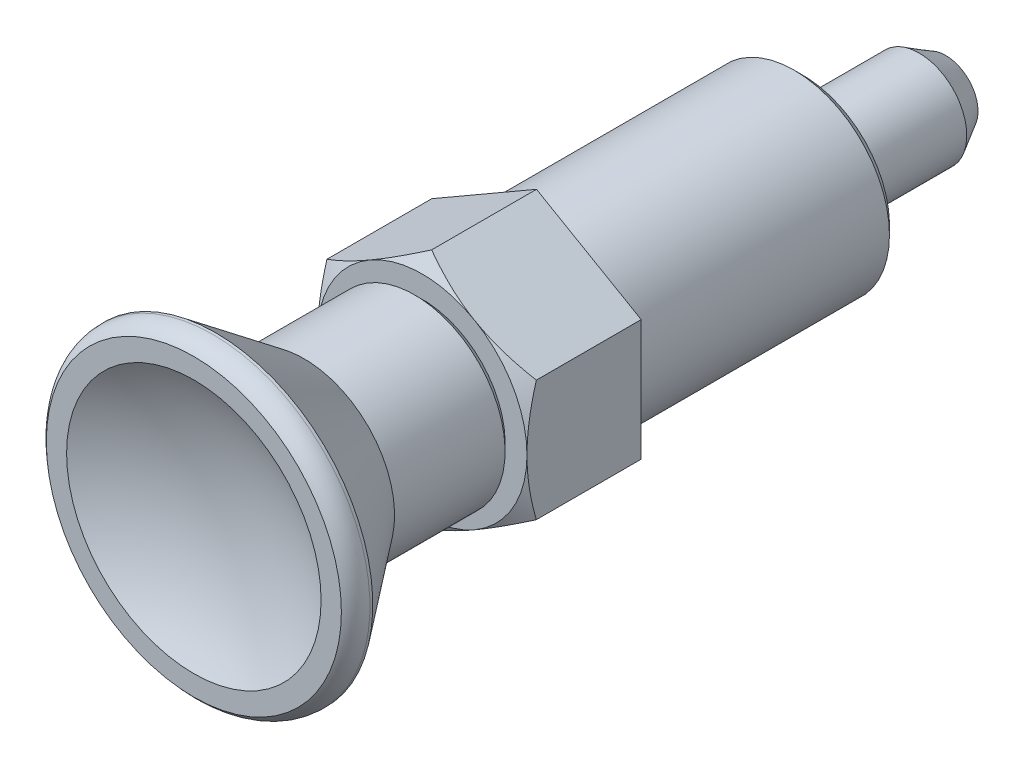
ISO-10303-21;
HEADER;
FILE_DESCRIPTION(('STEP AP214'),'2;1');
FILE_NAME('part.step','',(''),(''),'','','');
FILE_SCHEMA(('AUTOMOTIVE_DESIGN { 1 0 10303 214 1 1 1 1 }'));
ENDSEC;
DATA;
#1=APPLICATION_CONTEXT('core data for automotive mechanical design processes');
#2=APPLICATION_PROTOCOL_DEFINITION('international standard','automotive_design',2000,#1);
#3=PRODUCT_CONTEXT('',#1,'mechanical');
#4=PRODUCT('Part','Part','',(#3));
#5=PRODUCT_RELATED_PRODUCT_CATEGORY('part','',(#4));
#6=PRODUCT_DEFINITION_FORMATION('','',#4);
#7=PRODUCT_DEFINITION_CONTEXT('part definition',#1,'design');
#8=PRODUCT_DEFINITION('design','',#6,#7);
#9=PRODUCT_DEFINITION_SHAPE('','',#8);
#10=(LENGTH_UNIT() NAMED_UNIT(*) SI_UNIT(.MILLI.,.METRE.));
#11=(NAMED_UNIT(*) PLANE_ANGLE_UNIT() SI_UNIT($,.RADIAN.));
#12=(NAMED_UNIT(*) SI_UNIT($,.STERADIAN.) SOLID_ANGLE_UNIT());
#13=UNCERTAINTY_MEASURE_WITH_UNIT(LENGTH_MEASURE(1.E-05),#10,'distance_accuracy_value','');
#14=(GEOMETRIC_REPRESENTATION_CONTEXT(3) GLOBAL_UNCERTAINTY_ASSIGNED_CONTEXT((#13)) GLOBAL_UNIT_ASSIGNED_CONTEXT((#10,
#11,#12)) REPRESENTATION_CONTEXT('',''));
#15=CARTESIAN_POINT('',(0.,0.,0.));
#16=DIRECTION('',(0.,0.,1.));
#17=DIRECTION('',(1.,0.,0.));
#18=AXIS2_PLACEMENT_3D('',#15,#16,#17);
#19=CARTESIAN_POINT('',(0.,0.,10.2679491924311));
#20=DIRECTION('',(0.,0.,-1.));
#21=DIRECTION('',(0.,1.,0.));
#22=AXIS2_PLACEMENT_3D('',#19,#20,#21);
#23=CONICAL_SURFACE('',#22,14.,1.0471975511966);
#24=CARTESIAN_POINT('',(-11.,16.9475873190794,6.68579522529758));
#25=CARTESIAN_POINT('',(-11.,16.7078395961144,6.80189876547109));
#26=CARTESIAN_POINT('',(-11.,16.4678075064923,6.9174148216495));
#27=CARTESIAN_POINT('',(-11.,15.9871152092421,7.14713868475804));
#28=CARTESIAN_POINT('',(-11.,15.7464549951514,7.26134647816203));
#29=CARTESIAN_POINT('',(-11.,15.0233774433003,7.60183836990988));
#30=CARTESIAN_POINT('',(-11.,14.5399358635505,7.82595569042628));
#31=CARTESIAN_POINT('',(-11.,13.5670950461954,8.2682662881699));
#32=CARTESIAN_POINT('',(-11.,13.0776776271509,8.48641967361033));
#33=CARTESIAN_POINT('',(-11.,12.0949113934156,8.91365213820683));
#34=CARTESIAN_POINT('',(-11.,11.601562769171,9.12273165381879));
#35=CARTESIAN_POINT('',(-11.,10.5946510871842,9.53576885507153));
#36=CARTESIAN_POINT('',(-11.,10.0809379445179,9.73936259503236));
#37=CARTESIAN_POINT('',(-11.,9.04745673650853,10.130870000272));
#38=CARTESIAN_POINT('',(-11.,8.52768799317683,10.3187818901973));
#39=CARTESIAN_POINT('',(-11.,7.48229548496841,10.6739078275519));
#40=CARTESIAN_POINT('',(-11.,6.95668640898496,10.8411647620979));
#41=CARTESIAN_POINT('',(-11.,5.89787966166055,11.1495490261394));
#42=CARTESIAN_POINT('',(-11.,5.36468447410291,11.2906847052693));
#43=CARTESIAN_POINT('',(-11.,4.56058944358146,11.4772509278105));
#44=CARTESIAN_POINT('',(-11.,4.29255941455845,11.5351292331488));
#45=CARTESIAN_POINT('',(-11.,3.75468924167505,11.6418066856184));
#46=CARTESIAN_POINT('',(-11.,3.48484913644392,11.6906060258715));
#47=CARTESIAN_POINT('',(-11.,2.94355241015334,11.7782575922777));
#48=CARTESIAN_POINT('',(-11.,2.6720958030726,11.8171099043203));
#49=CARTESIAN_POINT('',(-11.,2.12786354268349,11.8840882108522));
#50=CARTESIAN_POINT('',(-11.,1.85508793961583,11.9122146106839));
#51=CARTESIAN_POINT('',(-11.,1.31211051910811,11.9568359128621));
#52=CARTESIAN_POINT('',(-11.,1.04192067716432,11.9734756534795));
#53=CARTESIAN_POINT('',(-11.,0.501080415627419,11.9953220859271));
#54=CARTESIAN_POINT('',(-11.,0.230430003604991,12.0005289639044));
#55=CARTESIAN_POINT('',(-11.,-0.310849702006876,11.9993861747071));
#56=CARTESIAN_POINT('',(-11.,-0.581478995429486,11.9930364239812));
#57=CARTESIAN_POINT('',(-11.,-1.12223262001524,11.9689333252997));
#58=CARTESIAN_POINT('',(-11.,-1.39235692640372,11.9511794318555));
#59=CARTESIAN_POINT('',(-11.,-2.04498166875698,11.8948814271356));
#60=CARTESIAN_POINT('',(-11.,-2.42700715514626,11.8507360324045));
#61=CARTESIAN_POINT('',(-11.,-3.18815089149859,11.7420670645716));
#62=CARTESIAN_POINT('',(-11.,-3.56726872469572,11.6775406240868));
#63=CARTESIAN_POINT('',(-11.,-4.32226099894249,11.5304052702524));
#64=CARTESIAN_POINT('',(-11.,-4.69813259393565,11.4477818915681));
#65=CARTESIAN_POINT('',(-11.,-5.44607034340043,11.2669675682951));
#66=CARTESIAN_POINT('',(-11.,-5.81813656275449,11.1687768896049));
#67=CARTESIAN_POINT('',(-11.,-6.56654933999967,10.9569168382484));
#68=CARTESIAN_POINT('',(-11.,-6.94281324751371,10.8429575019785));
#69=CARTESIAN_POINT('',(-11.,-7.69163354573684,10.6035085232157));
#70=CARTESIAN_POINT('',(-11.,-8.0641899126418,10.4780188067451));
#71=CARTESIAN_POINT('',(-11.,-8.80578324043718,10.2174800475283));
#72=CARTESIAN_POINT('',(-11.,-9.17482138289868,10.0824343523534));
#73=CARTESIAN_POINT('',(-11.,-9.90985646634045,9.80434835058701));
#74=CARTESIAN_POINT('',(-11.,-10.2758534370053,9.6613081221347));
#75=CARTESIAN_POINT('',(-11.,-11.1142135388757,9.3247854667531));
#76=CARTESIAN_POINT('',(-11.,-11.5856547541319,9.12901029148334));
#77=CARTESIAN_POINT('',(-11.,-12.5247285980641,8.7285047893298));
#78=CARTESIAN_POINT('',(-11.,-12.9923610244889,8.52377399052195));
#79=CARTESIAN_POINT('',(-11.,-13.9244936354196,8.10708188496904));
#80=CARTESIAN_POINT('',(-11.,-14.3889931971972,7.89511918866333));
#81=CARTESIAN_POINT('',(-11.,-15.3152712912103,7.46536426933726));
#82=CARTESIAN_POINT('',(-11.,-15.7770498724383,7.24757215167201));
#83=CARTESIAN_POINT('',(-11.,-16.6987730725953,6.80699211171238));
#84=CARTESIAN_POINT('',(-11.,-17.1587154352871,6.58419947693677));
#85=CARTESIAN_POINT('',(-11.,-18.0766600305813,6.13465365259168));
#86=CARTESIAN_POINT('',(-11.,-18.5346622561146,5.90790044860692));
#87=CARTESIAN_POINT('',(-11.,-19.4489632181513,5.45111550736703));
#88=CARTESIAN_POINT('',(-11.,-19.9052621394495,5.22108413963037));
#89=CARTESIAN_POINT('',(-11.,-20.8164463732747,4.75823700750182));
#90=CARTESIAN_POINT('',(-11.,-21.2713316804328,4.52542123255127));
#91=CARTESIAN_POINT('',(-11.,-22.562113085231,3.86056086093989));
#92=CARTESIAN_POINT('',(-11.,-23.3965608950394,3.42570443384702));
#93=CARTESIAN_POINT('',(-11.,-25.0623255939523,2.54998818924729));
#94=CARTESIAN_POINT('',(-11.,-25.893642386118,2.10912818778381));
#95=CARTESIAN_POINT('',(-11.,-27.5519148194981,1.22379199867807));
#96=CARTESIAN_POINT('',(-11.,-28.3788760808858,0.77932633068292));
#97=CARTESIAN_POINT('',(-11.,-29.6178277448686,0.109922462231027));
#98=CARTESIAN_POINT('',(-11.,-30.0305531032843,-0.113657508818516));
#99=CARTESIAN_POINT('',(-11.,-30.8555616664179,-0.561630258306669));
#100=CARTESIAN_POINT('',(-11.,-31.2678448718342,-0.786023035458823));
#101=CARTESIAN_POINT('',(-11.,-31.6799315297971,-1.0107762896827));
#102=B_SPLINE_CURVE_WITH_KNOTS('',3,(#24,#25,#26,#27,#28,#29,#30,#31,#32,#33,#34,#35,#36,#37,
#38,#39,#40,#41,#42,#43,#44,#45,#46,#47,#48,#49,#50,#51,#52,#53,#54,#55,#56,#57,#58,#59,#60,#61,
#62,#63,#64,#65,#66,#67,#68,#69,#70,#71,#72,#73,#74,#75,#76,#77,#78,#79,#80,#81,#82,#83,#84,#85,
#86,#87,#88,#89,#90,#91,#92,#93,#94,#95,#96,#97,#98,#99,#100,#101),.UNSPECIFIED.,.F.,.F.,(4,2,2,
2,2,2,2,2,2,2,2,2,2,2,2,2,2,2,2,2,2,2,2,2,2,2,2,2,2,2,2,2,2,2,2,2,2,2,4),(0.,0.799142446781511,
1.5982931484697,3.19683688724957,4.80427343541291,6.41163257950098,8.0691960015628,
9.72694682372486,11.3811955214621,13.0349145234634,13.8574094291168,14.6798868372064,
15.5023571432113,16.3247963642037,17.1366658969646,17.9485222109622,18.7603843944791,
19.5722854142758,20.7253478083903,21.8785724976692,23.0327223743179,24.1868525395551,
25.3660595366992,26.5452741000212,27.7240775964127,28.902869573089,30.434171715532,
31.9655546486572,33.4972335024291,35.0288846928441,36.5620455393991,38.0952119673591,
39.6282069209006,41.1612076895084,43.9840470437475,46.8069730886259,49.6234714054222,
51.0316511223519,52.439828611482),.UNSPECIFIED.);
#103=CARTESIAN_POINT('',(-11.,-6.3508529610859,11.0175196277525));
#104=VERTEX_POINT('',#103);
#105=CARTESIAN_POINT('',(-11.,0.,12.));
#106=VERTEX_POINT('',#105);
#107=EDGE_CURVE('E9',#104,#106,#102,.F.);
#108=ORIENTED_EDGE('',*,*,#107,.F.);
#109=CARTESIAN_POINT('',(0.000200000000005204,-12.7018213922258,11.0174529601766));
#110=CARTESIAN_POINT('',(-0.241603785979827,-12.5622159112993,11.0980408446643));
#111=CARTESIAN_POINT('',(-0.484309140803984,-12.4220899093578,11.1749710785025));
#112=CARTESIAN_POINT('',(-0.971666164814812,-12.1407142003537,11.3205013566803));
#113=CARTESIAN_POINT('',(-1.21631844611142,-11.9994641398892,11.3890986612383));
#114=CARTESIAN_POINT('',(-1.95421736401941,-11.5734380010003,11.5810636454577));
#115=CARTESIAN_POINT('',(-2.45037695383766,-11.2869801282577,11.6902522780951));
#116=CARTESIAN_POINT('',(-3.19285703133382,-10.8583090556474,11.8182858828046));
#117=CARTESIAN_POINT('',(-3.43695934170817,-10.7173765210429,11.8547577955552));
#118=CARTESIAN_POINT('',(-3.9262941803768,-10.4348589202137,11.9159186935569));
#119=CARTESIAN_POINT('',(-4.17152673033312,-10.2932738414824,11.9406074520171));
#120=CARTESIAN_POINT('',(-4.66240068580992,-10.0098676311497,11.9775696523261));
#121=CARTESIAN_POINT('',(-4.90804125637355,-9.86804698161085,11.9898578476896));
#122=CARTESIAN_POINT('',(-5.3995500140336,-9.58427426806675,12.0017570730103));
#123=CARTESIAN_POINT('',(-5.64541819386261,-9.4423222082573,12.0013684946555));
#124=CARTESIAN_POINT('',(-6.10507018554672,-9.17694200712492,11.9887988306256));
#125=CARTESIAN_POINT('',(-6.31888677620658,-9.05349494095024,11.9781509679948));
#126=CARTESIAN_POINT('',(-6.7460281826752,-8.80688473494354,11.9474683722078));
#127=CARTESIAN_POINT('',(-6.95935296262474,-8.68372161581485,11.9274329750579));
#128=CARTESIAN_POINT('',(-7.38539481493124,-8.43774623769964,11.8783246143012));
#129=CARTESIAN_POINT('',(-7.59811123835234,-8.31493435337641,11.8492441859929));
#130=CARTESIAN_POINT('',(-8.02254681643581,-8.06988635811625,11.7825560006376));
#131=CARTESIAN_POINT('',(-8.23426590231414,-7.94765028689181,11.7449476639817));
#132=CARTESIAN_POINT('',(-8.87695113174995,-7.57659579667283,11.6183800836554));
#133=CARTESIAN_POINT('',(-9.30605612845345,-7.32885191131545,11.5168005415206));
#134=CARTESIAN_POINT('',(-10.1578675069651,-6.83705838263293,11.286256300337));
#135=CARTESIAN_POINT('',(-10.580584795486,-6.59300244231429,11.1573457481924));
#136=CARTESIAN_POINT('',(-11.0002,-6.35073749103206,11.0174529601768));
#137=B_SPLINE_CURVE_WITH_KNOTS('',3,(#109,#110,#111,#112,#113,#114,#115,#116,#117,#118,#119,
#120,#121,#122,#123,#124,#125,#126,#127,#128,#129,#130,#131,#132,#133,#134,#135,#136),
.UNSPECIFIED.,.F.,.F.,(4,2,2,2,2,2,2,2,2,2,2,2,2,4),(0.,0.871755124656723,1.74379610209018,
3.49159027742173,4.34403665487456,5.19649943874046,6.04794680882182,6.89936787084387,
7.64056020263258,8.38180496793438,9.12366309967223,9.86557166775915,11.3820155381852,
12.8954827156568),.UNSPECIFIED.);
#138=CARTESIAN_POINT('',(-5.50000000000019,-9.52627944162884,12.));
#139=VERTEX_POINT('',#138);
#140=EDGE_CURVE('E201',#139,#104,#137,.T.);
#141=ORIENTED_EDGE('',*,*,#140,.F.);
#142=CARTESIAN_POINT('',(0.,0.,12.));
#143=DIRECTION('',(0.,0.,1.));
#144=DIRECTION('',(0.,-1.,0.));
#145=AXIS2_PLACEMENT_3D('',#142,#143,#144);
#146=CIRCLE('',#145,11.);
#147=EDGE_CURVE('E259',#106,#139,#146,.T.);
#148=ORIENTED_EDGE('',*,*,#147,.F.);
#149=EDGE_LOOP('',(#108,#141,#148));
#150=FACE_BOUND('',#149,.T.);
#151=ADVANCED_FACE('F14',(#150),#23,.T.);
#152=CARTESIAN_POINT('',(-11.,6.3508529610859,11.0175196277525));
#153=VERTEX_POINT('',#152);
#154=EDGE_CURVE('E18',#106,#153,#102,.F.);
#155=ORIENTED_EDGE('',*,*,#154,.F.);
#156=CARTESIAN_POINT('',(-5.50000000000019,9.52627944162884,12.));
#157=VERTEX_POINT('',#156);
#158=EDGE_CURVE('E116',#157,#106,#146,.T.);
#159=ORIENTED_EDGE('',*,*,#158,.F.);
#160=CARTESIAN_POINT('',(-11.0002,6.35073749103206,11.0174529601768));
#161=CARTESIAN_POINT('',(-10.7583962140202,6.49034297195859,11.0980408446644));
#162=CARTESIAN_POINT('',(-10.515690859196,6.63046897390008,11.1749710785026));
#163=CARTESIAN_POINT('',(-10.0283338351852,6.91184468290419,11.3205013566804));
#164=CARTESIAN_POINT('',(-9.78368155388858,7.05309474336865,11.3890986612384));
#165=CARTESIAN_POINT('',(-9.04578263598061,7.47912088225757,11.5810636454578));
#166=CARTESIAN_POINT('',(-8.54962304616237,7.76557875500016,11.6902522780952));
#167=CARTESIAN_POINT('',(-7.80714296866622,8.19424982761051,11.8182858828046));
#168=CARTESIAN_POINT('',(-7.56304065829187,8.33518236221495,11.8547577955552));
#169=CARTESIAN_POINT('',(-7.07370581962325,8.61769996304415,11.9159186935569));
#170=CARTESIAN_POINT('',(-6.82847326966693,8.7592850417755,11.9406074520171));
#171=CARTESIAN_POINT('',(-6.33759931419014,9.04269125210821,11.9775696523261));
#172=CARTESIAN_POINT('',(-6.09195874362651,9.18451190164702,11.9898578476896));
#173=CARTESIAN_POINT('',(-5.60044998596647,9.46828461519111,12.0017570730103));
#174=CARTESIAN_POINT('',(-5.35458180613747,9.61023667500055,12.0013684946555));
#175=CARTESIAN_POINT('',(-4.89492981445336,9.87561687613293,11.9887988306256));
#176=CARTESIAN_POINT('',(-4.6811132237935,9.99906394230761,11.9781509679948));
#177=CARTESIAN_POINT('',(-4.25397181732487,10.2456741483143,11.9474683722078));
#178=CARTESIAN_POINT('',(-4.04064703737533,10.368837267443,11.9274329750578));
#179=CARTESIAN_POINT('',(-3.61460518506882,10.6148126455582,11.8783246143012));
#180=CARTESIAN_POINT('',(-3.40188876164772,10.7376245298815,11.8492441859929));
#181=CARTESIAN_POINT('',(-2.97745318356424,10.9826725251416,11.7825560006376));
#182=CARTESIAN_POINT('',(-2.76573409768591,11.1049085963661,11.7449476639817));
#183=CARTESIAN_POINT('',(-2.12304886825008,11.475963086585,11.6183800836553));
#184=CARTESIAN_POINT('',(-1.69394387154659,11.7237069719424,11.5168005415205));
#185=CARTESIAN_POINT('',(-0.842132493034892,12.215500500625,11.2862563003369));
#186=CARTESIAN_POINT('',(-0.41941520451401,12.4595564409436,11.1573457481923));
#187=CARTESIAN_POINT('',(0.000199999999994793,12.7018213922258,11.0174529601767));
#188=B_SPLINE_CURVE_WITH_KNOTS('',3,(#160,#161,#162,#163,#164,#165,#166,#167,#168,#169,#170,
#171,#172,#173,#174,#175,#176,#177,#178,#179,#180,#181,#182,#183,#184,#185,#186,#187),
.UNSPECIFIED.,.F.,.F.,(4,2,2,2,2,2,2,2,2,2,2,2,2,4),(0.,0.871755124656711,1.74379610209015,
3.49159027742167,4.34403665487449,5.19649943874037,6.04794680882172,6.89936787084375,
7.64056020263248,8.38180496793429,9.12366309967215,9.86557166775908,11.3820155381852,
12.8954827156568),.UNSPECIFIED.);
#189=EDGE_CURVE('E262',#153,#157,#188,.T.);
#190=ORIENTED_EDGE('',*,*,#189,.F.);
#191=EDGE_LOOP('',(#155,#159,#190));
#192=FACE_BOUND('',#191,.T.);
#193=ADVANCED_FACE('F223',(#192),#23,.T.);
#194=CARTESIAN_POINT('',(0.,12.701705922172,11.0175196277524));
#195=VERTEX_POINT('',#194);
#196=EDGE_CURVE('E112',#157,#195,#188,.T.);
#197=ORIENTED_EDGE('',*,*,#196,.F.);
#198=CARTESIAN_POINT('',(5.50000000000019,9.52627944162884,12.));
#199=VERTEX_POINT('',#198);
#200=EDGE_CURVE('E110',#199,#157,#146,.T.);
#201=ORIENTED_EDGE('',*,*,#200,.F.);
#202=CARTESIAN_POINT('',(-0.000200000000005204,12.7018213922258,11.0174529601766));
#203=CARTESIAN_POINT('',(0.241603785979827,12.5622159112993,11.0980408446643));
#204=CARTESIAN_POINT('',(0.484309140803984,12.4220899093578,11.1749710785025));
#205=CARTESIAN_POINT('',(0.971666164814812,12.1407142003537,11.3205013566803));
#206=CARTESIAN_POINT('',(1.21631844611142,11.9994641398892,11.3890986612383));
#207=CARTESIAN_POINT('',(1.95421736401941,11.5734380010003,11.5810636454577));
#208=CARTESIAN_POINT('',(2.45037695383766,11.2869801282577,11.6902522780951));
#209=CARTESIAN_POINT('',(3.19285703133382,10.8583090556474,11.8182858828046));
#210=CARTESIAN_POINT('',(3.43695934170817,10.7173765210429,11.8547577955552));
#211=CARTESIAN_POINT('',(3.9262941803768,10.4348589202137,11.9159186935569));
#212=CARTESIAN_POINT('',(4.17152673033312,10.2932738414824,11.9406074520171));
#213=CARTESIAN_POINT('',(4.66240068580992,10.0098676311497,11.9775696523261));
#214=CARTESIAN_POINT('',(4.90804125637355,9.86804698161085,11.9898578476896));
#215=CARTESIAN_POINT('',(5.3995500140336,9.58427426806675,12.0017570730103));
#216=CARTESIAN_POINT('',(5.64541819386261,9.4423222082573,12.0013684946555));
#217=CARTESIAN_POINT('',(6.10507018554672,9.17694200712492,11.9887988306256));
#218=CARTESIAN_POINT('',(6.31888677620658,9.05349494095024,11.9781509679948));
#219=CARTESIAN_POINT('',(6.7460281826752,8.80688473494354,11.9474683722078));
#220=CARTESIAN_POINT('',(6.95935296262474,8.68372161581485,11.9274329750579));
#221=CARTESIAN_POINT('',(7.38539481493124,8.43774623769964,11.8783246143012));
#222=CARTESIAN_POINT('',(7.59811123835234,8.31493435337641,11.8492441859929));
#223=CARTESIAN_POINT('',(8.02254681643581,8.06988635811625,11.7825560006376));
#224=CARTESIAN_POINT('',(8.23426590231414,7.94765028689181,11.7449476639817));
#225=CARTESIAN_POINT('',(8.87695113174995,7.57659579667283,11.6183800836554));
#226=CARTESIAN_POINT('',(9.30605612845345,7.32885191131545,11.5168005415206));
#227=CARTESIAN_POINT('',(10.1578675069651,6.83705838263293,11.286256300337));
#228=CARTESIAN_POINT('',(10.580584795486,6.59300244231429,11.1573457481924));
#229=CARTESIAN_POINT('',(11.0002,6.35073749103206,11.0174529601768));
#230=B_SPLINE_CURVE_WITH_KNOTS('',3,(#202,#203,#204,#205,#206,#207,#208,#209,#210,#211,#212,
#213,#214,#215,#216,#217,#218,#219,#220,#221,#222,#223,#224,#225,#226,#227,#228,#229),
.UNSPECIFIED.,.F.,.F.,(4,2,2,2,2,2,2,2,2,2,2,2,2,4),(0.,0.871755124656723,1.74379610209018,
3.49159027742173,4.34403665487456,5.19649943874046,6.04794680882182,6.89936787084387,
7.64056020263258,8.38180496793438,9.12366309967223,9.86557166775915,11.3820155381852,
12.8954827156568),.UNSPECIFIED.);
#231=EDGE_CURVE('E90',#195,#199,#230,.T.);
#232=ORIENTED_EDGE('',*,*,#231,.F.);
#233=EDGE_LOOP('',(#197,#201,#232));
#234=FACE_BOUND('',#233,.T.);
#235=ADVANCED_FACE('F111',(#234),#23,.T.);
#236=CARTESIAN_POINT('',(0.,-12.701705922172,11.0175196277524));
#237=VERTEX_POINT('',#236);
#238=EDGE_CURVE('E196',#237,#139,#137,.T.);
#239=ORIENTED_EDGE('',*,*,#238,.F.);
#240=CARTESIAN_POINT('',(11.0002,-6.35073749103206,11.0174529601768));
#241=CARTESIAN_POINT('',(10.7583962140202,-6.49034297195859,11.0980408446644));
#242=CARTESIAN_POINT('',(10.515690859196,-6.63046897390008,11.1749710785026));
#243=CARTESIAN_POINT('',(10.0283338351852,-6.91184468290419,11.3205013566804));
#244=CARTESIAN_POINT('',(9.78368155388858,-7.05309474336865,11.3890986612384));
#245=CARTESIAN_POINT('',(9.04578263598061,-7.47912088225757,11.5810636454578));
#246=CARTESIAN_POINT('',(8.54962304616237,-7.76557875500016,11.6902522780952));
#247=CARTESIAN_POINT('',(7.80714296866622,-8.19424982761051,11.8182858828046));
#248=CARTESIAN_POINT('',(7.56304065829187,-8.33518236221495,11.8547577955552));
#249=CARTESIAN_POINT('',(7.07370581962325,-8.61769996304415,11.9159186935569));
#250=CARTESIAN_POINT('',(6.82847326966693,-8.7592850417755,11.9406074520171));
#251=CARTESIAN_POINT('',(6.33759931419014,-9.04269125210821,11.9775696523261));
#252=CARTESIAN_POINT('',(6.09195874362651,-9.18451190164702,11.9898578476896));
#253=CARTESIAN_POINT('',(5.60044998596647,-9.46828461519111,12.0017570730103));
#254=CARTESIAN_POINT('',(5.35458180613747,-9.61023667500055,12.0013684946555));
#255=CARTESIAN_POINT('',(4.89492981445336,-9.87561687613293,11.9887988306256));
#256=CARTESIAN_POINT('',(4.6811132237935,-9.99906394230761,11.9781509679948));
#257=CARTESIAN_POINT('',(4.25397181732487,-10.2456741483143,11.9474683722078));
#258=CARTESIAN_POINT('',(4.04064703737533,-10.368837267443,11.9274329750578));
#259=CARTESIAN_POINT('',(3.61460518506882,-10.6148126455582,11.8783246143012));
#260=CARTESIAN_POINT('',(3.40188876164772,-10.7376245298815,11.8492441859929));
#261=CARTESIAN_POINT('',(2.97745318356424,-10.9826725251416,11.7825560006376));
#262=CARTESIAN_POINT('',(2.76573409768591,-11.1049085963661,11.7449476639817));
#263=CARTESIAN_POINT('',(2.12304886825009,-11.475963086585,11.6183800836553));
#264=CARTESIAN_POINT('',(1.69394387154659,-11.7237069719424,11.5168005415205));
#265=CARTESIAN_POINT('',(0.842132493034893,-12.215500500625,11.2862563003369));
#266=CARTESIAN_POINT('',(0.419415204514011,-12.4595564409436,11.1573457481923));
#267=CARTESIAN_POINT('',(-0.00019999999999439,-12.7018213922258,11.0174529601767));
#268=B_SPLINE_CURVE_WITH_KNOTS('',3,(#240,#241,#242,#243,#244,#245,#246,#247,#248,#249,#250,
#251,#252,#253,#254,#255,#256,#257,#258,#259,#260,#261,#262,#263,#264,#265,#266,#267),
.UNSPECIFIED.,.F.,.F.,(4,2,2,2,2,2,2,2,2,2,2,2,2,4),(0.,0.871755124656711,1.74379610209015,
3.49159027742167,4.34403665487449,5.19649943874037,6.04794680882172,6.89936787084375,
7.64056020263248,8.38180496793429,9.12366309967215,9.86557166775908,11.3820155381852,
12.8954827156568),.UNSPECIFIED.);
#269=CARTESIAN_POINT('',(5.50000000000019,-9.52627944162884,12.));
#270=VERTEX_POINT('',#269);
#271=EDGE_CURVE('E100',#270,#237,#268,.T.);
#272=ORIENTED_EDGE('',*,*,#271,.F.);
#273=EDGE_CURVE('E123',#139,#270,#146,.T.);
#274=ORIENTED_EDGE('',*,*,#273,.F.);
#275=EDGE_LOOP('',(#239,#272,#274));
#276=FACE_BOUND('',#275,.T.);
#277=ADVANCED_FACE('F241',(#276),#23,.T.);
#278=CARTESIAN_POINT('',(11.,6.3508529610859,11.0175196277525));
#279=VERTEX_POINT('',#278);
#280=EDGE_CURVE('E94',#199,#279,#230,.T.);
#281=ORIENTED_EDGE('',*,*,#280,.F.);
#282=CARTESIAN_POINT('',(11.,0.,12.));
#283=VERTEX_POINT('',#282);
#284=EDGE_CURVE('E106',#283,#199,#146,.T.);
#285=ORIENTED_EDGE('',*,*,#284,.F.);
#286=CARTESIAN_POINT('',(11.,16.9475873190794,6.68579522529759));
#287=CARTESIAN_POINT('',(11.,16.7078395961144,6.8018987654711));
#288=CARTESIAN_POINT('',(11.,16.4678075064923,6.9174148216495));
#289=CARTESIAN_POINT('',(11.,15.9871152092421,7.14713868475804));
#290=CARTESIAN_POINT('',(11.,15.7464549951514,7.26134647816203));
#291=CARTESIAN_POINT('',(11.,15.0233774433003,7.60183836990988));
#292=CARTESIAN_POINT('',(11.,14.5399358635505,7.82595569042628));
#293=CARTESIAN_POINT('',(11.,13.5670950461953,8.26826628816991));
#294=CARTESIAN_POINT('',(11.,13.0776776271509,8.48641967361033));
#295=CARTESIAN_POINT('',(11.,12.0949113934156,8.91365213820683));
#296=CARTESIAN_POINT('',(11.,11.601562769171,9.12273165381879));
#297=CARTESIAN_POINT('',(11.,10.5946510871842,9.53576885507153));
#298=CARTESIAN_POINT('',(11.,10.0809379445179,9.73936259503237));
#299=CARTESIAN_POINT('',(11.,9.04745673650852,10.1308700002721));
#300=CARTESIAN_POINT('',(11.,8.52768799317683,10.3187818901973));
#301=CARTESIAN_POINT('',(11.,7.48229548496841,10.6739078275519));
#302=CARTESIAN_POINT('',(11.,6.95668640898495,10.8411647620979));
#303=CARTESIAN_POINT('',(11.,5.89787966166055,11.1495490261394));
#304=CARTESIAN_POINT('',(11.,5.36468447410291,11.2906847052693));
#305=CARTESIAN_POINT('',(11.,4.56058944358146,11.4772509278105));
#306=CARTESIAN_POINT('',(11.,4.29255941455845,11.5351292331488));
#307=CARTESIAN_POINT('',(11.,3.75468924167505,11.6418066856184));
#308=CARTESIAN_POINT('',(11.,3.48484913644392,11.6906060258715));
#309=CARTESIAN_POINT('',(11.,2.94355241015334,11.7782575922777));
#310=CARTESIAN_POINT('',(11.,2.6720958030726,11.8171099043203));
#311=CARTESIAN_POINT('',(11.,2.12786354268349,11.8840882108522));
#312=CARTESIAN_POINT('',(11.,1.85508793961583,11.9122146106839));
#313=CARTESIAN_POINT('',(11.,1.31211051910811,11.9568359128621));
#314=CARTESIAN_POINT('',(11.,1.04192067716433,11.9734756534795));
#315=CARTESIAN_POINT('',(11.,0.50108041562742,11.9953220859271));
#316=CARTESIAN_POINT('',(11.,0.230430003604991,12.0005289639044));
#317=CARTESIAN_POINT('',(11.,-0.310849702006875,11.9993861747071));
#318=CARTESIAN_POINT('',(11.,-0.581478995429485,11.9930364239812));
#319=CARTESIAN_POINT('',(11.,-1.12223262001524,11.9689333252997));
#320=CARTESIAN_POINT('',(11.,-1.39235692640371,11.9511794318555));
#321=CARTESIAN_POINT('',(11.,-2.04498166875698,11.8948814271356));
#322=CARTESIAN_POINT('',(11.,-2.42700715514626,11.8507360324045));
#323=CARTESIAN_POINT('',(11.,-3.18815089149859,11.7420670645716));
#324=CARTESIAN_POINT('',(11.,-3.56726872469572,11.6775406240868));
#325=CARTESIAN_POINT('',(11.,-4.32226099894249,11.5304052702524));
#326=CARTESIAN_POINT('',(11.,-4.69813259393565,11.4477818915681));
#327=CARTESIAN_POINT('',(11.,-5.44607034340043,11.2669675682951));
#328=CARTESIAN_POINT('',(11.,-5.81813656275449,11.1687768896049));
#329=CARTESIAN_POINT('',(11.,-6.56654933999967,10.9569168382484));
#330=CARTESIAN_POINT('',(11.,-6.94281324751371,10.8429575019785));
#331=CARTESIAN_POINT('',(11.,-7.69163354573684,10.6035085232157));
#332=CARTESIAN_POINT('',(11.,-8.0641899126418,10.4780188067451));
#333=CARTESIAN_POINT('',(11.,-8.80578324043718,10.2174800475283));
#334=CARTESIAN_POINT('',(11.,-9.17482138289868,10.0824343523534));
#335=CARTESIAN_POINT('',(11.,-9.90985646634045,9.80434835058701));
#336=CARTESIAN_POINT('',(11.,-10.2758534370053,9.6613081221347));
#337=CARTESIAN_POINT('',(11.,-11.1142135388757,9.3247854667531));
#338=CARTESIAN_POINT('',(11.,-11.5856547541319,9.12901029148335));
#339=CARTESIAN_POINT('',(11.,-12.5247285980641,8.7285047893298));
#340=CARTESIAN_POINT('',(11.,-12.9923610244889,8.52377399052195));
#341=CARTESIAN_POINT('',(11.,-13.9244936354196,8.10708188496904));
#342=CARTESIAN_POINT('',(11.,-14.3889931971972,7.89511918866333));
#343=CARTESIAN_POINT('',(11.,-15.3152712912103,7.46536426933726));
#344=CARTESIAN_POINT('',(11.,-15.7770498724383,7.24757215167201));
#345=CARTESIAN_POINT('',(11.,-16.6987730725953,6.80699211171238));
#346=CARTESIAN_POINT('',(11.,-17.1587154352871,6.58419947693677));
#347=CARTESIAN_POINT('',(11.,-18.0766600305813,6.13465365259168));
#348=CARTESIAN_POINT('',(11.,-18.5346622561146,5.90790044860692));
#349=CARTESIAN_POINT('',(11.,-19.4489632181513,5.45111550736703));
#350=CARTESIAN_POINT('',(11.,-19.9052621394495,5.22108413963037));
#351=CARTESIAN_POINT('',(11.,-20.8164463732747,4.75823700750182));
#352=CARTESIAN_POINT('',(11.,-21.2713316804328,4.52542123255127));
#353=CARTESIAN_POINT('',(11.,-22.562113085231,3.86056086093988));
#354=CARTESIAN_POINT('',(11.,-23.3965608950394,3.42570443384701));
#355=CARTESIAN_POINT('',(11.,-25.0623255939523,2.54998818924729));
#356=CARTESIAN_POINT('',(11.,-25.893642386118,2.10912818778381));
#357=CARTESIAN_POINT('',(11.,-27.5519148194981,1.22379199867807));
#358=CARTESIAN_POINT('',(11.,-28.3788760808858,0.779326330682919));
#359=CARTESIAN_POINT('',(11.,-29.6178277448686,0.109922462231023));
#360=CARTESIAN_POINT('',(11.,-30.0305531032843,-0.113657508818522));
#361=CARTESIAN_POINT('',(11.,-30.8555616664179,-0.561630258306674));
#362=CARTESIAN_POINT('',(11.,-31.2678448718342,-0.786023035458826));
#363=CARTESIAN_POINT('',(11.,-31.6799315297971,-1.0107762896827));
#364=B_SPLINE_CURVE_WITH_KNOTS('',3,(#286,#287,#288,#289,#290,#291,#292,#293,#294,#295,#296,
#297,#298,#299,#300,#301,#302,#303,#304,#305,#306,#307,#308,#309,#310,#311,#312,#313,#314,#315,
#316,#317,#318,#319,#320,#321,#322,#323,#324,#325,#326,#327,#328,#329,#330,#331,#332,#333,#334,
#335,#336,#337,#338,#339,#340,#341,#342,#343,#344,#345,#346,#347,#348,#349,#350,#351,#352,#353,
#354,#355,#356,#357,#358,#359,#360,#361,#362,#363),.UNSPECIFIED.,.F.,.F.,(4,2,2,2,2,2,2,2,2,2,2,
2,2,2,2,2,2,2,2,2,2,2,2,2,2,2,2,2,2,2,2,2,2,2,2,2,2,2,4),(0.,0.799142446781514,1.5982931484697,
3.19683688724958,4.80427343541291,6.41163257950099,8.06919600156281,9.72694682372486,
11.3811955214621,13.0349145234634,13.8574094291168,14.6798868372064,15.5023571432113,
16.3247963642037,17.1366658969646,17.9485222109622,18.7603843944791,19.5722854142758,
20.7253478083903,21.8785724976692,23.0327223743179,24.1868525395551,25.3660595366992,
26.5452741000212,27.7240775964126,28.902869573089,30.434171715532,31.9655546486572,
33.4972335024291,35.0288846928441,36.5620455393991,38.0952119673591,39.6282069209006,
41.1612076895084,43.9840470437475,46.8069730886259,49.6234714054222,51.0316511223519,
52.439828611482),.UNSPECIFIED.);
#365=EDGE_CURVE('E41',#279,#283,#364,.T.);
#366=ORIENTED_EDGE('',*,*,#365,.F.);
#367=EDGE_LOOP('',(#281,#285,#366));
#368=FACE_BOUND('',#367,.T.);
#369=ADVANCED_FACE('F104',(#368),#23,.T.);
#370=CARTESIAN_POINT('',(11.,-6.3508529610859,11.0175196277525));
#371=VERTEX_POINT('',#370);
#372=EDGE_CURVE('E108',#371,#270,#268,.T.);
#373=ORIENTED_EDGE('',*,*,#372,.F.);
#374=EDGE_CURVE('E166',#283,#371,#364,.T.);
#375=ORIENTED_EDGE('',*,*,#374,.F.);
#376=EDGE_CURVE('E121',#270,#283,#146,.T.);
#377=ORIENTED_EDGE('',*,*,#376,.F.);
#378=EDGE_LOOP('',(#373,#375,#377));
#379=FACE_BOUND('',#378,.T.);
#380=ADVANCED_FACE('F225',(#379),#23,.T.);
#381=CARTESIAN_POINT('',(-2.8275992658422E-12,0.,58.3000000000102));
#382=DIRECTION('',(0.,0.,1.));
#383=DIRECTION('',(1.,0.,0.));
#384=AXIS2_PLACEMENT_3D('',#381,#382,#383);
#385=SPHERICAL_SURFACE('',#384,26.0000000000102);
#386=CARTESIAN_POINT('',(0.,0.,36.));
#387=DIRECTION('',(0.,0.,1.));
#388=DIRECTION('',(0.,-1.,0.));
#389=AXIS2_PLACEMENT_3D('',#386,#387,#388);
#390=CIRCLE('',#389,13.36824595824);
#391=CARTESIAN_POINT('',(0.,-13.36824595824,36.));
#392=VERTEX_POINT('',#391);
#393=EDGE_CURVE('E163',#392,#392,#390,.T.);
#394=ORIENTED_EDGE('',*,*,#393,.T.);
#395=EDGE_LOOP('',(#394));
#396=FACE_BOUND('',#395,.T.);
#397=ADVANCED_FACE('F16',(#396),#385,.F.);
#398=CARTESIAN_POINT('',(13.36824595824,0.,36.));
#399=DIRECTION('',(0.,0.,1.));
#400=DIRECTION('',(0.,-1.,0.));
#401=AXIS2_PLACEMENT_3D('',#398,#399,#400);
#402=PLANE('',#401);
#403=CARTESIAN_POINT('',(0.,0.,36.));
#404=DIRECTION('',(0.,0.,1.));
#405=DIRECTION('',(0.,-1.,0.));
#406=AXIS2_PLACEMENT_3D('',#403,#404,#405);
#407=CIRCLE('',#406,15.5);
#408=CARTESIAN_POINT('',(0.,-15.5,36.));
#409=VERTEX_POINT('',#408);
#410=EDGE_CURVE('E160',#409,#409,#407,.T.);
#411=ORIENTED_EDGE('',*,*,#410,.T.);
#412=EDGE_LOOP('',(#411));
#413=FACE_BOUND('',#412,.T.);
#414=ORIENTED_EDGE('',*,*,#393,.F.);
#415=EDGE_LOOP('',(#414));
#416=FACE_BOUND('',#415,.T.);
#417=ADVANCED_FACE('F239',(#413,#416),#402,.T.);
#418=CARTESIAN_POINT('',(0.,0.,34.000000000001));
#419=DIRECTION('',(0.,0.,1.));
#420=DIRECTION('',(0.,-1.,0.));
#421=AXIS2_PLACEMENT_3D('',#418,#419,#420);
#422=TOROIDAL_SURFACE('',#421,14.000000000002,2.499999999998);
#423=CARTESIAN_POINT('',(0.,0.,34.));
#424=DIRECTION('',(0.,0.,1.));
#425=DIRECTION('',(0.,-1.,0.));
#426=AXIS2_PLACEMENT_3D('',#423,#424,#425);
#427=CIRCLE('',#426,16.5);
#428=CARTESIAN_POINT('',(0.,-16.5,34.));
#429=VERTEX_POINT('',#428);
#430=EDGE_CURVE('E157',#429,#429,#427,.T.);
#431=ORIENTED_EDGE('',*,*,#430,.T.);
#432=EDGE_LOOP('',(#431));
#433=FACE_BOUND('',#432,.T.);
#434=ORIENTED_EDGE('',*,*,#410,.F.);
#435=EDGE_LOOP('',(#434));
#436=FACE_BOUND('',#435,.T.);
#437=ADVANCED_FACE('F335',(#433,#436),#422,.T.);
#438=CARTESIAN_POINT('',(0.,0.,-43.));
#439=DIRECTION('',(0.,0.,1.));
#440=DIRECTION('',(0.,-1.,0.));
#441=AXIS2_PLACEMENT_3D('',#438,#439,#440);
#442=CYLINDRICAL_SURFACE('',#441,16.5);
#443=CARTESIAN_POINT('',(0.,0.,33.7));
#444=DIRECTION('',(0.,0.,1.));
#445=DIRECTION('',(0.,-1.,0.));
#446=AXIS2_PLACEMENT_3D('',#443,#444,#445);
#447=CIRCLE('',#446,16.5);
#448=CARTESIAN_POINT('',(0.,-16.5,33.7));
#449=VERTEX_POINT('',#448);
#450=EDGE_CURVE('E154',#449,#449,#447,.T.);
#451=ORIENTED_EDGE('',*,*,#450,.T.);
#452=EDGE_LOOP('',(#451));
#453=FACE_BOUND('',#452,.T.);
#454=ORIENTED_EDGE('',*,*,#430,.F.);
#455=EDGE_LOOP('',(#454));
#456=FACE_BOUND('',#455,.T.);
#457=ADVANCED_FACE('F331',(#453,#456),#442,.T.);
#458=CARTESIAN_POINT('',(0.,0.,33.7));
#459=DIRECTION('',(0.,0.,1.));
#460=DIRECTION('',(0.,-1.,0.));
#461=AXIS2_PLACEMENT_3D('',#458,#459,#460);
#462=CONICAL_SURFACE('',#461,16.5,0.645771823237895);
#463=CARTESIAN_POINT('',(0.,0.,24.410686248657));
#464=DIRECTION('',(0.,0.,1.));
#465=DIRECTION('',(0.,-1.,0.));
#466=AXIS2_PLACEMENT_3D('',#463,#464,#465);
#467=CIRCLE('',#466,9.5);
#468=CARTESIAN_POINT('',(0.,-9.5,24.410686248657));
#469=VERTEX_POINT('',#468);
#470=EDGE_CURVE('E151',#469,#469,#467,.T.);
#471=ORIENTED_EDGE('',*,*,#470,.T.);
#472=EDGE_LOOP('',(#471));
#473=FACE_BOUND('',#472,.T.);
#474=ORIENTED_EDGE('',*,*,#450,.F.);
#475=EDGE_LOOP('',(#474));
#476=FACE_BOUND('',#475,.T.);
#477=ADVANCED_FACE('F327',(#473,#476),#462,.T.);
#478=CARTESIAN_POINT('',(0.,0.,-43.));
#479=DIRECTION('',(0.,0.,1.));
#480=DIRECTION('',(0.,-1.,0.));
#481=AXIS2_PLACEMENT_3D('',#478,#479,#480);
#482=CYLINDRICAL_SURFACE('',#481,9.5);
#483=CARTESIAN_POINT('',(0.,0.,12.8));
#484=DIRECTION('',(0.,0.,1.));
#485=DIRECTION('',(0.,-1.,0.));
#486=AXIS2_PLACEMENT_3D('',#483,#484,#485);
#487=CIRCLE('',#486,9.5);
#488=CARTESIAN_POINT('',(0.,-9.5,12.8));
#489=VERTEX_POINT('',#488);
#490=EDGE_CURVE('E148',#489,#489,#487,.T.);
#491=ORIENTED_EDGE('',*,*,#490,.T.);
#492=EDGE_LOOP('',(#491));
#493=FACE_BOUND('',#492,.T.);
#494=ORIENTED_EDGE('',*,*,#470,.F.);
#495=EDGE_LOOP('',(#494));
#496=FACE_BOUND('',#495,.T.);
#497=ADVANCED_FACE('F323',(#493,#496),#482,.T.);
#498=CARTESIAN_POINT('',(0.,0.,12.8));
#499=DIRECTION('',(0.,0.,1.));
#500=DIRECTION('',(0.,-1.,0.));
#501=AXIS2_PLACEMENT_3D('',#498,#499,#500);
#502=CONICAL_SURFACE('',#501,9.5,0.785398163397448);
#503=CARTESIAN_POINT('',(0.,0.,12.));
#504=DIRECTION('',(0.,0.,1.));
#505=DIRECTION('',(0.,-1.,0.));
#506=AXIS2_PLACEMENT_3D('',#503,#504,#505);
#507=CIRCLE('',#506,8.7);
#508=CARTESIAN_POINT('',(0.,-8.7,12.));
#509=VERTEX_POINT('',#508);
#510=EDGE_CURVE('E145',#509,#509,#507,.T.);
#511=ORIENTED_EDGE('',*,*,#510,.T.);
#512=EDGE_LOOP('',(#511));
#513=FACE_BOUND('',#512,.T.);
#514=ORIENTED_EDGE('',*,*,#490,.F.);
#515=EDGE_LOOP('',(#514));
#516=FACE_BOUND('',#515,.T.);
#517=ADVANCED_FACE('F312',(#513,#516),#502,.T.);
#518=CARTESIAN_POINT('',(11.,0.,12.));
#519=DIRECTION('',(0.,0.,-1.));
#520=DIRECTION('',(0.,1.,0.));
#521=AXIS2_PLACEMENT_3D('',#518,#519,#520);
#522=PLANE('',#521);
#523=ORIENTED_EDGE('',*,*,#510,.F.);
#524=EDGE_LOOP('',(#523));
#525=FACE_BOUND('',#524,.T.);
#526=ORIENTED_EDGE('',*,*,#376,.T.);
#527=ORIENTED_EDGE('',*,*,#284,.T.);
#528=ORIENTED_EDGE('',*,*,#200,.T.);
#529=ORIENTED_EDGE('',*,*,#158,.T.);
#530=ORIENTED_EDGE('',*,*,#147,.T.);
#531=ORIENTED_EDGE('',*,*,#273,.T.);
#532=EDGE_LOOP('',(#526,#527,#528,#529,#530,#531));
#533=FACE_BOUND('',#532,.T.);
#534=ADVANCED_FACE('F118',(#525,#533),#522,.F.);
#535=CARTESIAN_POINT('',(11.,6.3508529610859,-2.));
#536=DIRECTION('',(0.500000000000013,0.866025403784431,0.));
#537=DIRECTION('',(-0.866025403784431,0.500000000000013,0.));
#538=AXIS2_PLACEMENT_3D('',#535,#536,#537);
#539=PLANE('',#538);
#540=DIRECTION('',(-0.866025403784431,0.500000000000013,0.));
#541=VECTOR('',#540,1.);
#542=CARTESIAN_POINT('',(13.,5.19615242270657,0.));
#543=LINE('',#542,#541);
#544=CARTESIAN_POINT('',(11.,6.3508529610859,0.));
#545=VERTEX_POINT('',#544);
#546=CARTESIAN_POINT('',(0.,12.701705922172,0.));
#547=VERTEX_POINT('',#546);
#548=EDGE_CURVE('E126',#545,#547,#543,.T.);
#549=ORIENTED_EDGE('',*,*,#548,.T.);
#550=DIRECTION('',(0.,0.,1.));
#551=VECTOR('',#550,1.);
#552=CARTESIAN_POINT('',(0.,12.701705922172,-2.));
#553=LINE('',#552,#551);
#554=EDGE_CURVE('E96',#547,#195,#553,.T.);
#555=ORIENTED_EDGE('',*,*,#554,.T.);
#556=ORIENTED_EDGE('',*,*,#231,.T.);
#557=ORIENTED_EDGE('',*,*,#280,.T.);
#558=DIRECTION('',(0.,0.,1.));
#559=VECTOR('',#558,1.);
#560=CARTESIAN_POINT('',(11.,6.3508529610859,-2.));
#561=LINE('',#560,#559);
#562=EDGE_CURVE('E282',#545,#279,#561,.T.);
#563=ORIENTED_EDGE('',*,*,#562,.F.);
#564=EDGE_LOOP('',(#549,#555,#556,#557,#563));
#565=FACE_BOUND('',#564,.T.);
#566=ADVANCED_FACE('F92',(#565),#539,.T.);
#567=CARTESIAN_POINT('',(0.,12.701705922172,-2.));
#568=DIRECTION('',(-0.500000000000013,0.866025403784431,0.));
#569=DIRECTION('',(-0.866025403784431,-0.500000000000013,0.));
#570=AXIS2_PLACEMENT_3D('',#567,#568,#569);
#571=PLANE('',#570);
#572=DIRECTION('',(-0.866025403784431,-0.500000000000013,0.));
#573=VECTOR('',#572,1.);
#574=CARTESIAN_POINT('',(1.99999999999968,13.8564064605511,0.));
#575=LINE('',#574,#573);
#576=CARTESIAN_POINT('',(-11.,6.3508529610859,0.));
#577=VERTEX_POINT('',#576);
#578=EDGE_CURVE('E266',#547,#577,#575,.T.);
#579=ORIENTED_EDGE('',*,*,#578,.T.);
#580=DIRECTION('',(0.,0.,1.));
#581=VECTOR('',#580,1.);
#582=CARTESIAN_POINT('',(-11.,6.3508529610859,-2.));
#583=LINE('',#582,#581);
#584=EDGE_CURVE('E269',#577,#153,#583,.T.);
#585=ORIENTED_EDGE('',*,*,#584,.T.);
#586=ORIENTED_EDGE('',*,*,#189,.T.);
#587=ORIENTED_EDGE('',*,*,#196,.T.);
#588=ORIENTED_EDGE('',*,*,#554,.F.);
#589=EDGE_LOOP('',(#579,#585,#586,#587,#588));
#590=FACE_BOUND('',#589,.T.);
#591=ADVANCED_FACE('F190',(#590),#571,.T.);
#592=CARTESIAN_POINT('',(-11.,6.3508529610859,-2.));
#593=DIRECTION('',(-1.,0.,0.));
#594=DIRECTION('',(0.,-1.,0.));
#595=AXIS2_PLACEMENT_3D('',#592,#593,#594);
#596=PLANE('',#595);
#597=DIRECTION('',(0.,-1.,0.));
#598=VECTOR('',#597,1.);
#599=CARTESIAN_POINT('',(-11.,0.,0.));
#600=LINE('',#599,#598);
#601=CARTESIAN_POINT('',(-11.,-6.3508529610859,0.));
#602=VERTEX_POINT('',#601);
#603=EDGE_CURVE('E275',#577,#602,#600,.T.);
#604=ORIENTED_EDGE('',*,*,#603,.T.);
#605=DIRECTION('',(0.,0.,1.));
#606=VECTOR('',#605,1.);
#607=CARTESIAN_POINT('',(-11.,-6.3508529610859,-2.));
#608=LINE('',#607,#606);
#609=EDGE_CURVE('E256',#602,#104,#608,.T.);
#610=ORIENTED_EDGE('',*,*,#609,.T.);
#611=ORIENTED_EDGE('',*,*,#107,.T.);
#612=ORIENTED_EDGE('',*,*,#154,.T.);
#613=ORIENTED_EDGE('',*,*,#584,.F.);
#614=EDGE_LOOP('',(#604,#610,#611,#612,#613));
#615=FACE_BOUND('',#614,.T.);
#616=ADVANCED_FACE('F210',(#615),#596,.T.);
#617=CARTESIAN_POINT('',(-11.,-6.3508529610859,-2.));
#618=DIRECTION('',(-0.500000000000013,-0.866025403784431,0.));
#619=DIRECTION('',(0.866025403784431,-0.500000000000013,0.));
#620=AXIS2_PLACEMENT_3D('',#617,#618,#619);
#621=PLANE('',#620);
#622=DIRECTION('',(0.866025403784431,-0.500000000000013,0.));
#623=VECTOR('',#622,1.);
#624=CARTESIAN_POINT('',(1.99999999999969,-13.8564064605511,0.));
#625=LINE('',#624,#623);
#626=CARTESIAN_POINT('',(0.,-12.701705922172,0.));
#627=VERTEX_POINT('',#626);
#628=EDGE_CURVE('E255',#602,#627,#625,.T.);
#629=ORIENTED_EDGE('',*,*,#628,.T.);
#630=DIRECTION('',(0.,0.,1.));
#631=VECTOR('',#630,1.);
#632=CARTESIAN_POINT('',(0.,-12.701705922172,-2.));
#633=LINE('',#632,#631);
#634=EDGE_CURVE('E247',#627,#237,#633,.T.);
#635=ORIENTED_EDGE('',*,*,#634,.T.);
#636=ORIENTED_EDGE('',*,*,#238,.T.);
#637=ORIENTED_EDGE('',*,*,#140,.T.);
#638=ORIENTED_EDGE('',*,*,#609,.F.);
#639=EDGE_LOOP('',(#629,#635,#636,#637,#638));
#640=FACE_BOUND('',#639,.T.);
#641=ADVANCED_FACE('F207',(#640),#621,.T.);
#642=CARTESIAN_POINT('',(0.,-12.701705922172,-2.));
#643=DIRECTION('',(0.500000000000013,-0.866025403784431,0.));
#644=DIRECTION('',(0.866025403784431,0.500000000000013,0.));
#645=AXIS2_PLACEMENT_3D('',#642,#643,#644);
#646=PLANE('',#645);
#647=DIRECTION('',(0.866025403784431,0.500000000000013,0.));
#648=VECTOR('',#647,1.);
#649=CARTESIAN_POINT('',(13.,-5.19615242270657,0.));
#650=LINE('',#649,#648);
#651=CARTESIAN_POINT('',(11.,-6.3508529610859,0.));
#652=VERTEX_POINT('',#651);
#653=EDGE_CURVE('E279',#627,#652,#650,.T.);
#654=ORIENTED_EDGE('',*,*,#653,.T.);
#655=DIRECTION('',(0.,0.,1.));
#656=VECTOR('',#655,1.);
#657=CARTESIAN_POINT('',(11.,-6.3508529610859,-2.));
#658=LINE('',#657,#656);
#659=EDGE_CURVE('E35',#652,#371,#658,.T.);
#660=ORIENTED_EDGE('',*,*,#659,.T.);
#661=ORIENTED_EDGE('',*,*,#372,.T.);
#662=ORIENTED_EDGE('',*,*,#271,.T.);
#663=ORIENTED_EDGE('',*,*,#634,.F.);
#664=EDGE_LOOP('',(#654,#660,#661,#662,#663));
#665=FACE_BOUND('',#664,.T.);
#666=ADVANCED_FACE('F185',(#665),#646,.T.);
#667=CARTESIAN_POINT('',(11.,-6.3508529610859,-2.));
#668=DIRECTION('',(1.,0.,0.));
#669=DIRECTION('',(0.,1.,0.));
#670=AXIS2_PLACEMENT_3D('',#667,#668,#669);
#671=PLANE('',#670);
#672=DIRECTION('',(0.,1.,0.));
#673=VECTOR('',#672,1.);
#674=CARTESIAN_POINT('',(11.,0.,0.));
#675=LINE('',#674,#673);
#676=EDGE_CURVE('E268',#652,#545,#675,.T.);
#677=ORIENTED_EDGE('',*,*,#676,.T.);
#678=ORIENTED_EDGE('',*,*,#562,.T.);
#679=ORIENTED_EDGE('',*,*,#365,.T.);
#680=ORIENTED_EDGE('',*,*,#374,.T.);
#681=ORIENTED_EDGE('',*,*,#659,.F.);
#682=EDGE_LOOP('',(#677,#678,#679,#680,#681));
#683=FACE_BOUND('',#682,.T.);
#684=ADVANCED_FACE('F181',(#683),#671,.T.);
#685=CARTESIAN_POINT('',(10.,0.,0.));
#686=DIRECTION('',(0.,0.,1.));
#687=DIRECTION('',(0.,-1.,0.));
#688=AXIS2_PLACEMENT_3D('',#685,#686,#687);
#689=PLANE('',#688);
#690=CARTESIAN_POINT('',(0.,0.,0.));
#691=DIRECTION('',(0.,0.,1.));
#692=DIRECTION('',(0.,-1.,0.));
#693=AXIS2_PLACEMENT_3D('',#690,#691,#692);
#694=CIRCLE('',#693,10.);
#695=CARTESIAN_POINT('',(0.,-10.,0.));
#696=VERTEX_POINT('',#695);
#697=EDGE_CURVE('E122',#696,#696,#694,.T.);
#698=ORIENTED_EDGE('',*,*,#697,.T.);
#699=EDGE_LOOP('',(#698));
#700=FACE_BOUND('',#699,.T.);
#701=ORIENTED_EDGE('',*,*,#548,.F.);
#702=ORIENTED_EDGE('',*,*,#676,.F.);
#703=ORIENTED_EDGE('',*,*,#653,.F.);
#704=ORIENTED_EDGE('',*,*,#628,.F.);
#705=ORIENTED_EDGE('',*,*,#603,.F.);
#706=ORIENTED_EDGE('',*,*,#578,.F.);
#707=EDGE_LOOP('',(#701,#702,#703,#704,#705,#706));
#708=FACE_BOUND('',#707,.T.);
#709=ADVANCED_FACE('F184',(#700,#708),#689,.F.);
#710=CARTESIAN_POINT('',(3.3834192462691,0.,-43.));
#711=DIRECTION('',(0.,0.,-1.));
#712=DIRECTION('',(0.,1.,0.));
#713=AXIS2_PLACEMENT_3D('',#710,#711,#712);
#714=PLANE('',#713);
#715=CARTESIAN_POINT('',(0.,0.,-43.));
#716=DIRECTION('',(0.,0.,1.));
#717=DIRECTION('',(0.,-1.,0.));
#718=AXIS2_PLACEMENT_3D('',#715,#716,#717);
#719=CIRCLE('',#718,3.3834192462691);
#720=CARTESIAN_POINT('',(0.,-3.3834192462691,-43.));
#721=VERTEX_POINT('',#720);
#722=EDGE_CURVE('E139',#721,#721,#719,.T.);
#723=ORIENTED_EDGE('',*,*,#722,.F.);
#724=EDGE_LOOP('',(#723));
#725=FACE_BOUND('',#724,.T.);
#726=ADVANCED_FACE('F288',(#725),#714,.T.);
#727=CARTESIAN_POINT('',(0.,0.,-40.2));
#728=DIRECTION('',(0.,0.,1.));
#729=DIRECTION('',(0.,-1.,0.));
#730=AXIS2_PLACEMENT_3D('',#727,#728,#729);
#731=CONICAL_SURFACE('',#730,5.,0.523598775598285);
#732=ORIENTED_EDGE('',*,*,#722,.T.);
#733=EDGE_LOOP('',(#732));
#734=FACE_BOUND('',#733,.T.);
#735=CARTESIAN_POINT('',(0.,0.,-40.2));
#736=DIRECTION('',(0.,0.,1.));
#737=DIRECTION('',(0.,-1.,0.));
#738=AXIS2_PLACEMENT_3D('',#735,#736,#737);
#739=CIRCLE('',#738,5.);
#740=CARTESIAN_POINT('',(0.,-5.,-40.2));
#741=VERTEX_POINT('',#740);
#742=EDGE_CURVE('E142',#741,#741,#739,.T.);
#743=ORIENTED_EDGE('',*,*,#742,.F.);
#744=EDGE_LOOP('',(#743));
#745=FACE_BOUND('',#744,.T.);
#746=ADVANCED_FACE('F294',(#734,#745),#731,.T.);
#747=CARTESIAN_POINT('',(0.,0.,-43.));
#748=DIRECTION('',(0.,0.,1.));
#749=DIRECTION('',(0.,-1.,0.));
#750=AXIS2_PLACEMENT_3D('',#747,#748,#749);
#751=CYLINDRICAL_SURFACE('',#750,5.);
#752=ORIENTED_EDGE('',*,*,#742,.T.);
#753=EDGE_LOOP('',(#752));
#754=FACE_BOUND('',#753,.T.);
#755=CARTESIAN_POINT('',(0.,0.,-28.));
#756=DIRECTION('',(0.,0.,1.));
#757=DIRECTION('',(0.,-1.,0.));
#758=AXIS2_PLACEMENT_3D('',#755,#756,#757);
#759=CIRCLE('',#758,5.);
#760=CARTESIAN_POINT('',(0.,-5.,-28.));
#761=VERTEX_POINT('',#760);
#762=EDGE_CURVE('E136',#761,#761,#759,.T.);
#763=ORIENTED_EDGE('',*,*,#762,.F.);
#764=EDGE_LOOP('',(#763));
#765=FACE_BOUND('',#764,.T.);
#766=ADVANCED_FACE('F309',(#754,#765),#751,.T.);
#767=CARTESIAN_POINT('',(5.,0.,-28.));
#768=DIRECTION('',(0.,0.,1.));
#769=DIRECTION('',(0.,-1.,0.));
#770=AXIS2_PLACEMENT_3D('',#767,#768,#769);
#771=PLANE('',#770);
#772=CARTESIAN_POINT('',(0.,0.,-28.));
#773=DIRECTION('',(0.,0.,1.));
#774=DIRECTION('',(0.,-1.,0.));
#775=AXIS2_PLACEMENT_3D('',#772,#773,#774);
#776=CIRCLE('',#775,9.08);
#777=CARTESIAN_POINT('',(0.,-9.08,-28.));
#778=VERTEX_POINT('',#777);
#779=EDGE_CURVE('E133',#778,#778,#776,.T.);
#780=ORIENTED_EDGE('',*,*,#779,.F.);
#781=EDGE_LOOP('',(#780));
#782=FACE_BOUND('',#781,.T.);
#783=ORIENTED_EDGE('',*,*,#762,.T.);
#784=EDGE_LOOP('',(#783));
#785=FACE_BOUND('',#784,.T.);
#786=ADVANCED_FACE('F305',(#782,#785),#771,.F.);
#787=CARTESIAN_POINT('',(0.,0.,-28.));
#788=DIRECTION('',(0.,0.,1.));
#789=DIRECTION('',(0.,-1.,0.));
#790=AXIS2_PLACEMENT_3D('',#787,#788,#789);
#791=CONICAL_SURFACE('',#790,9.08,0.785398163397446);
#792=CARTESIAN_POINT('',(0.,0.,-27.08));
#793=DIRECTION('',(0.,0.,1.));
#794=DIRECTION('',(0.,-1.,0.));
#795=AXIS2_PLACEMENT_3D('',#792,#793,#794);
#796=CIRCLE('',#795,10.);
#797=CARTESIAN_POINT('',(0.,-10.,-27.08));
#798=VERTEX_POINT('',#797);
#799=EDGE_CURVE('E130',#798,#798,#796,.T.);
#800=ORIENTED_EDGE('',*,*,#799,.F.);
#801=EDGE_LOOP('',(#800));
#802=FACE_BOUND('',#801,.T.);
#803=ORIENTED_EDGE('',*,*,#779,.T.);
#804=EDGE_LOOP('',(#803));
#805=FACE_BOUND('',#804,.T.);
#806=ADVANCED_FACE('F301',(#802,#805),#791,.T.);
#807=CARTESIAN_POINT('',(0.,0.,-28.));
#808=DIRECTION('',(0.,0.,1.));
#809=DIRECTION('',(0.,-1.,0.));
#810=AXIS2_PLACEMENT_3D('',#807,#808,#809);
#811=CYLINDRICAL_SURFACE('',#810,10.);
#812=ORIENTED_EDGE('',*,*,#799,.T.);
#813=EDGE_LOOP('',(#812));
#814=FACE_BOUND('',#813,.T.);
#815=ORIENTED_EDGE('',*,*,#697,.F.);
#816=EDGE_LOOP('',(#815));
#817=FACE_BOUND('',#816,.T.);
#818=ADVANCED_FACE('F298',(#814,#817),#811,.T.);
#819=CLOSED_SHELL('',(#151,#193,#235,#277,#369,#380,#397,#417,#437,#457,#477,#497,#517,#534,
#566,#591,#616,#641,#666,#684,#709,#726,#746,#766,#786,#806,#818));
#820=MANIFOLD_SOLID_BREP('B1',#819);
#821=ADVANCED_BREP_SHAPE_REPRESENTATION('',(#18,#820),#14);
#822=SHAPE_DEFINITION_REPRESENTATION(#9,#821);
ENDSEC;
END-ISO-10303-21;
